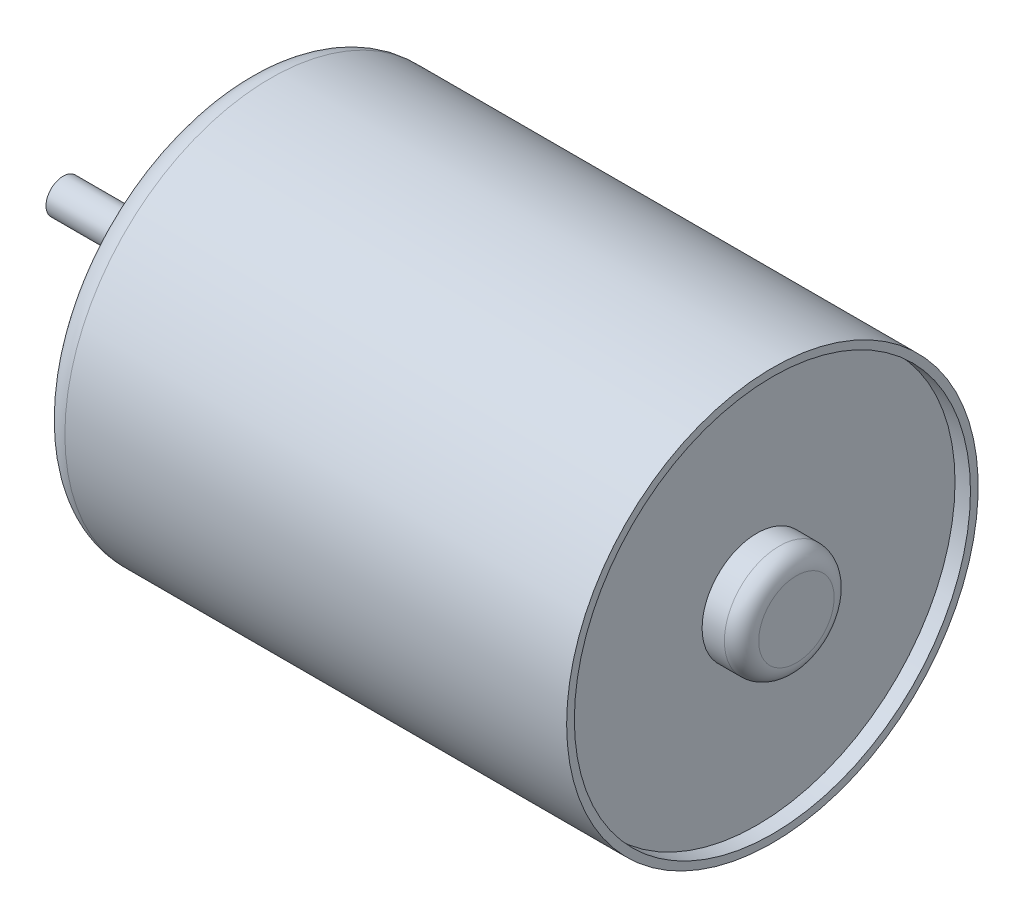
ISO-10303-21;
HEADER;
FILE_DESCRIPTION(('STEP AP214'),'2;1');
FILE_NAME('part.step','',(''),(''),'','','');
FILE_SCHEMA(('AUTOMOTIVE_DESIGN { 1 0 10303 214 1 1 1 1 }'));
ENDSEC;
DATA;
#1=APPLICATION_CONTEXT('core data for automotive mechanical design processes');
#2=APPLICATION_PROTOCOL_DEFINITION('international standard','automotive_design',2000,#1);
#3=PRODUCT_CONTEXT('',#1,'mechanical');
#4=PRODUCT('Part','Part','',(#3));
#5=PRODUCT_RELATED_PRODUCT_CATEGORY('part','',(#4));
#6=PRODUCT_DEFINITION_FORMATION('','',#4);
#7=PRODUCT_DEFINITION_CONTEXT('part definition',#1,'design');
#8=PRODUCT_DEFINITION('design','',#6,#7);
#9=PRODUCT_DEFINITION_SHAPE('','',#8);
#10=(LENGTH_UNIT() NAMED_UNIT(*) SI_UNIT(.MILLI.,.METRE.));
#11=(NAMED_UNIT(*) PLANE_ANGLE_UNIT() SI_UNIT($,.RADIAN.));
#12=(NAMED_UNIT(*) SI_UNIT($,.STERADIAN.) SOLID_ANGLE_UNIT());
#13=UNCERTAINTY_MEASURE_WITH_UNIT(LENGTH_MEASURE(1.E-05),#10,'distance_accuracy_value','');
#14=(GEOMETRIC_REPRESENTATION_CONTEXT(3) GLOBAL_UNCERTAINTY_ASSIGNED_CONTEXT((#13)) GLOBAL_UNIT_ASSIGNED_CONTEXT((#10,
#11,#12)) REPRESENTATION_CONTEXT('',''));
#15=CARTESIAN_POINT('',(0.,0.,0.));
#16=DIRECTION('',(0.,0.,1.));
#17=DIRECTION('',(1.,0.,0.));
#18=AXIS2_PLACEMENT_3D('',#15,#16,#17);
#19=CARTESIAN_POINT('',(-1.07616271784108,27.1669435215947,0.));
#20=DIRECTION('',(-1.,0.,0.));
#21=DIRECTION('',(0.,0.,1.));
#22=AXIS2_PLACEMENT_3D('',#19,#20,#21);
#23=PLANE('',#22);
#24=CARTESIAN_POINT('',(-1.07616271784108,27.1669435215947,0.));
#25=DIRECTION('',(-1.,0.,0.));
#26=DIRECTION('',(0.,0.,1.));
#27=AXIS2_PLACEMENT_3D('',#24,#25,#26);
#28=CIRCLE('',#27,11.55);
#29=CARTESIAN_POINT('',(-1.07616271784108,27.1669435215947,11.55));
#30=VERTEX_POINT('',#29);
#31=EDGE_CURVE('E54',#30,#30,#28,.T.);
#32=ORIENTED_EDGE('',*,*,#31,.F.);
#33=EDGE_LOOP('',(#32));
#34=FACE_BOUND('',#33,.T.);
#35=CARTESIAN_POINT('',(-1.07616271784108,27.1669435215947,0.));
#36=DIRECTION('',(-1.,0.,0.));
#37=DIRECTION('',(0.,0.,1.));
#38=AXIS2_PLACEMENT_3D('',#35,#36,#37);
#39=CIRCLE('',#38,3.2);
#40=CARTESIAN_POINT('',(-1.07616271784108,27.1669435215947,3.2));
#41=VERTEX_POINT('',#40);
#42=EDGE_CURVE('E42',#41,#41,#39,.F.);
#43=ORIENTED_EDGE('',*,*,#42,.F.);
#44=EDGE_LOOP('',(#43));
#45=FACE_BOUND('',#44,.T.);
#46=ADVANCED_FACE('F31',(#34,#45),#23,.F.);
#47=CARTESIAN_POINT('',(-41.5361627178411,27.1669435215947,0.));
#48=DIRECTION('',(-1.,0.,0.));
#49=DIRECTION('',(0.,0.,1.));
#50=AXIS2_PLACEMENT_3D('',#47,#48,#49);
#51=CYLINDRICAL_SURFACE('',#50,11.55);
#52=CARTESIAN_POINT('',(-0.176162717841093,27.1669435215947,0.));
#53=DIRECTION('',(-1.,0.,0.));
#54=DIRECTION('',(0.,0.,1.));
#55=AXIS2_PLACEMENT_3D('',#52,#53,#54);
#56=CIRCLE('',#55,11.55);
#57=CARTESIAN_POINT('',(-0.176162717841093,27.1669435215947,11.55));
#58=VERTEX_POINT('',#57);
#59=EDGE_CURVE('E57',#58,#58,#56,.T.);
#60=ORIENTED_EDGE('',*,*,#59,.F.);
#61=EDGE_LOOP('',(#60));
#62=FACE_BOUND('',#61,.T.);
#63=ORIENTED_EDGE('',*,*,#31,.T.);
#64=EDGE_LOOP('',(#63));
#65=FACE_BOUND('',#64,.T.);
#66=ADVANCED_FACE('F126',(#62,#65),#51,.F.);
#67=CARTESIAN_POINT('',(-0.176162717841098,39.1669435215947,0.));
#68=DIRECTION('',(-1.,0.,0.));
#69=DIRECTION('',(0.,0.,1.));
#70=AXIS2_PLACEMENT_3D('',#67,#68,#69);
#71=PLANE('',#70);
#72=CARTESIAN_POINT('',(-0.1761627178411,27.1669435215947,0.));
#73=DIRECTION('',(-1.,0.,0.));
#74=DIRECTION('',(0.,0.,1.));
#75=AXIS2_PLACEMENT_3D('',#72,#73,#74);
#76=CIRCLE('',#75,12.);
#77=CARTESIAN_POINT('',(-0.1761627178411,27.1669435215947,12.));
#78=VERTEX_POINT('',#77);
#79=EDGE_CURVE('E60',#78,#78,#76,.T.);
#80=ORIENTED_EDGE('',*,*,#79,.F.);
#81=EDGE_LOOP('',(#80));
#82=FACE_BOUND('',#81,.T.);
#83=ORIENTED_EDGE('',*,*,#59,.T.);
#84=EDGE_LOOP('',(#83));
#85=FACE_BOUND('',#84,.T.);
#86=ADVANCED_FACE('F122',(#82,#85),#71,.F.);
#87=CARTESIAN_POINT('',(-41.5361627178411,27.1669435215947,0.));
#88=DIRECTION('',(-1.,0.,0.));
#89=DIRECTION('',(0.,0.,1.));
#90=AXIS2_PLACEMENT_3D('',#87,#88,#89);
#91=CYLINDRICAL_SURFACE('',#90,12.);
#92=CARTESIAN_POINT('',(-29.4361627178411,27.1669435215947,0.));
#93=DIRECTION('',(1.,0.,0.));
#94=DIRECTION('',(0.,0.,-1.));
#95=AXIS2_PLACEMENT_3D('',#92,#93,#94);
#96=CIRCLE('',#95,12.);
#97=CARTESIAN_POINT('',(-29.4361627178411,27.1669435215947,-12.));
#98=VERTEX_POINT('',#97);
#99=EDGE_CURVE('E46',#98,#98,#96,.T.);
#100=ORIENTED_EDGE('',*,*,#99,.T.);
#101=EDGE_LOOP('',(#100));
#102=FACE_BOUND('',#101,.T.);
#103=ORIENTED_EDGE('',*,*,#79,.T.);
#104=EDGE_LOOP('',(#103));
#105=FACE_BOUND('',#104,.T.);
#106=ADVANCED_FACE('F116',(#102,#105),#91,.T.);
#107=CARTESIAN_POINT('',(-30.9361627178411,30.3669435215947,0.));
#108=DIRECTION('',(1.,0.,0.));
#109=DIRECTION('',(0.,0.,-1.));
#110=AXIS2_PLACEMENT_3D('',#107,#108,#109);
#111=PLANE('',#110);
#112=CARTESIAN_POINT('',(-30.9361627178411,27.1669435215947,0.));
#113=DIRECTION('',(1.,0.,0.));
#114=DIRECTION('',(0.,0.,-1.));
#115=AXIS2_PLACEMENT_3D('',#112,#113,#114);
#116=CIRCLE('',#115,10.5);
#117=CARTESIAN_POINT('',(-30.9361627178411,27.1669435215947,-10.5));
#118=VERTEX_POINT('',#117);
#119=EDGE_CURVE('E51',#118,#118,#116,.F.);
#120=ORIENTED_EDGE('',*,*,#119,.T.);
#121=EDGE_LOOP('',(#120));
#122=FACE_BOUND('',#121,.T.);
#123=CARTESIAN_POINT('',(-30.9361627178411,27.1669435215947,0.));
#124=DIRECTION('',(-1.,0.,0.));
#125=DIRECTION('',(0.,0.,1.));
#126=AXIS2_PLACEMENT_3D('',#123,#124,#125);
#127=CIRCLE('',#126,3.2);
#128=CARTESIAN_POINT('',(-30.9361627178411,27.1669435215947,3.2));
#129=VERTEX_POINT('',#128);
#130=EDGE_CURVE('E63',#129,#129,#127,.T.);
#131=ORIENTED_EDGE('',*,*,#130,.F.);
#132=EDGE_LOOP('',(#131));
#133=FACE_BOUND('',#132,.T.);
#134=ADVANCED_FACE('F111',(#122,#133),#111,.F.);
#135=CARTESIAN_POINT('',(-41.5361627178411,27.1669435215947,0.));
#136=DIRECTION('',(-1.,0.,0.));
#137=DIRECTION('',(0.,0.,1.));
#138=AXIS2_PLACEMENT_3D('',#135,#136,#137);
#139=CYLINDRICAL_SURFACE('',#138,3.2);
#140=CARTESIAN_POINT('',(-32.5361627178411,27.1669435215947,0.));
#141=DIRECTION('',(-1.,0.,0.));
#142=DIRECTION('',(0.,0.,1.));
#143=AXIS2_PLACEMENT_3D('',#140,#141,#142);
#144=CIRCLE('',#143,3.2);
#145=CARTESIAN_POINT('',(-32.5361627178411,27.1669435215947,3.2));
#146=VERTEX_POINT('',#145);
#147=EDGE_CURVE('E66',#146,#146,#144,.T.);
#148=ORIENTED_EDGE('',*,*,#147,.F.);
#149=EDGE_LOOP('',(#148));
#150=FACE_BOUND('',#149,.T.);
#151=ORIENTED_EDGE('',*,*,#130,.T.);
#152=EDGE_LOOP('',(#151));
#153=FACE_BOUND('',#152,.T.);
#154=ADVANCED_FACE('F105',(#150,#153),#139,.T.);
#155=CARTESIAN_POINT('',(-32.5361627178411,29.7669435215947,0.));
#156=DIRECTION('',(1.,0.,0.));
#157=DIRECTION('',(0.,0.,-1.));
#158=AXIS2_PLACEMENT_3D('',#155,#156,#157);
#159=PLANE('',#158);
#160=CARTESIAN_POINT('',(-32.5361627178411,27.1669435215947,0.));
#161=DIRECTION('',(-1.,0.,0.));
#162=DIRECTION('',(0.,0.,1.));
#163=AXIS2_PLACEMENT_3D('',#160,#161,#162);
#164=CIRCLE('',#163,2.6);
#165=CARTESIAN_POINT('',(-32.5361627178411,27.1669435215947,2.6));
#166=VERTEX_POINT('',#165);
#167=EDGE_CURVE('E69',#166,#166,#164,.T.);
#168=ORIENTED_EDGE('',*,*,#167,.F.);
#169=EDGE_LOOP('',(#168));
#170=FACE_BOUND('',#169,.T.);
#171=ORIENTED_EDGE('',*,*,#147,.T.);
#172=EDGE_LOOP('',(#171));
#173=FACE_BOUND('',#172,.T.);
#174=ADVANCED_FACE('F99',(#170,#173),#159,.F.);
#175=CARTESIAN_POINT('',(-41.5361627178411,27.1669435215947,0.));
#176=DIRECTION('',(-1.,0.,0.));
#177=DIRECTION('',(0.,0.,1.));
#178=AXIS2_PLACEMENT_3D('',#175,#176,#177);
#179=CYLINDRICAL_SURFACE('',#178,2.6);
#180=CARTESIAN_POINT('',(-32.0361627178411,27.1669435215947,0.));
#181=DIRECTION('',(-1.,0.,0.));
#182=DIRECTION('',(0.,0.,1.));
#183=AXIS2_PLACEMENT_3D('',#180,#181,#182);
#184=CIRCLE('',#183,2.6);
#185=CARTESIAN_POINT('',(-32.0361627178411,27.1669435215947,2.6));
#186=VERTEX_POINT('',#185);
#187=EDGE_CURVE('E72',#186,#186,#184,.T.);
#188=ORIENTED_EDGE('',*,*,#187,.F.);
#189=EDGE_LOOP('',(#188));
#190=FACE_BOUND('',#189,.T.);
#191=ORIENTED_EDGE('',*,*,#167,.T.);
#192=EDGE_LOOP('',(#191));
#193=FACE_BOUND('',#192,.T.);
#194=ADVANCED_FACE('F93',(#190,#193),#179,.F.);
#195=CARTESIAN_POINT('',(-32.0361627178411,28.1669435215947,0.));
#196=DIRECTION('',(1.,0.,0.));
#197=DIRECTION('',(0.,0.,-1.));
#198=AXIS2_PLACEMENT_3D('',#195,#196,#197);
#199=PLANE('',#198);
#200=CARTESIAN_POINT('',(-32.0361627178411,27.1669435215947,0.));
#201=DIRECTION('',(-1.,0.,0.));
#202=DIRECTION('',(0.,0.,1.));
#203=AXIS2_PLACEMENT_3D('',#200,#201,#202);
#204=CIRCLE('',#203,1.);
#205=CARTESIAN_POINT('',(-32.0361627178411,27.1669435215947,1.));
#206=VERTEX_POINT('',#205);
#207=EDGE_CURVE('E75',#206,#206,#204,.T.);
#208=ORIENTED_EDGE('',*,*,#207,.F.);
#209=EDGE_LOOP('',(#208));
#210=FACE_BOUND('',#209,.T.);
#211=ORIENTED_EDGE('',*,*,#187,.T.);
#212=EDGE_LOOP('',(#211));
#213=FACE_BOUND('',#212,.T.);
#214=ADVANCED_FACE('F87',(#210,#213),#199,.F.);
#215=CARTESIAN_POINT('',(-41.5361627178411,27.1669435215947,0.));
#216=DIRECTION('',(-1.,0.,0.));
#217=DIRECTION('',(0.,0.,1.));
#218=AXIS2_PLACEMENT_3D('',#215,#216,#217);
#219=CYLINDRICAL_SURFACE('',#218,1.);
#220=CARTESIAN_POINT('',(-41.5361627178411,27.1669435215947,0.));
#221=DIRECTION('',(-1.,0.,0.));
#222=DIRECTION('',(0.,0.,1.));
#223=AXIS2_PLACEMENT_3D('',#220,#221,#222);
#224=CIRCLE('',#223,1.);
#225=CARTESIAN_POINT('',(-41.5361627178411,27.1669435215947,1.));
#226=VERTEX_POINT('',#225);
#227=EDGE_CURVE('E78',#226,#226,#224,.T.);
#228=ORIENTED_EDGE('',*,*,#227,.F.);
#229=EDGE_LOOP('',(#228));
#230=FACE_BOUND('',#229,.T.);
#231=ORIENTED_EDGE('',*,*,#207,.T.);
#232=EDGE_LOOP('',(#231));
#233=FACE_BOUND('',#232,.T.);
#234=ADVANCED_FACE('F84',(#230,#233),#219,.T.);
#235=CARTESIAN_POINT('',(-41.5361627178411,27.1669435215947,0.));
#236=DIRECTION('',(1.,0.,0.));
#237=DIRECTION('',(0.,0.,-1.));
#238=AXIS2_PLACEMENT_3D('',#235,#236,#237);
#239=PLANE('',#238);
#240=ORIENTED_EDGE('',*,*,#227,.T.);
#241=EDGE_LOOP('',(#240));
#242=FACE_BOUND('',#241,.T.);
#243=ADVANCED_FACE('F82',(#242),#239,.F.);
#244=CARTESIAN_POINT('',(-29.4361627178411,27.1669435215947,0.));
#245=DIRECTION('',(1.,0.,0.));
#246=DIRECTION('',(0.,0.,-1.));
#247=AXIS2_PLACEMENT_3D('',#244,#245,#246);
#248=TOROIDAL_SURFACE('',#247,10.5,1.5);
#249=ORIENTED_EDGE('',*,*,#99,.F.);
#250=EDGE_LOOP('',(#249));
#251=FACE_BOUND('',#250,.T.);
#252=ORIENTED_EDGE('',*,*,#119,.F.);
#253=EDGE_LOOP('',(#252));
#254=FACE_BOUND('',#253,.T.);
#255=ADVANCED_FACE('F137',(#251,#254),#248,.T.);
#256=CARTESIAN_POINT('',(1.22383728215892,27.1669435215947,0.));
#257=DIRECTION('',(-1.,0.,0.));
#258=DIRECTION('',(0.,0.,1.));
#259=AXIS2_PLACEMENT_3D('',#256,#257,#258);
#260=CYLINDRICAL_SURFACE('',#259,3.2);
#261=CARTESIAN_POINT('',(0.223837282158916,27.1669435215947,0.));
#262=DIRECTION('',(1.,0.,0.));
#263=DIRECTION('',(0.,0.,-1.));
#264=AXIS2_PLACEMENT_3D('',#261,#262,#263);
#265=CIRCLE('',#264,3.2);
#266=CARTESIAN_POINT('',(0.223837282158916,27.1669435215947,-3.2));
#267=VERTEX_POINT('',#266);
#268=EDGE_CURVE('E10',#267,#267,#265,.F.);
#269=ORIENTED_EDGE('',*,*,#268,.T.);
#270=EDGE_LOOP('',(#269));
#271=FACE_BOUND('',#270,.T.);
#272=ORIENTED_EDGE('',*,*,#42,.T.);
#273=EDGE_LOOP('',(#272));
#274=FACE_BOUND('',#273,.T.);
#275=ADVANCED_FACE('F139',(#271,#274),#260,.T.);
#276=CARTESIAN_POINT('',(1.22383728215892,27.1669435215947,0.));
#277=DIRECTION('',(1.,0.,0.));
#278=DIRECTION('',(0.,0.,-1.));
#279=AXIS2_PLACEMENT_3D('',#276,#277,#278);
#280=PLANE('',#279);
#281=CARTESIAN_POINT('',(1.22383728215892,27.1669435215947,0.));
#282=DIRECTION('',(1.,0.,0.));
#283=DIRECTION('',(0.,0.,-1.));
#284=AXIS2_PLACEMENT_3D('',#281,#282,#283);
#285=CIRCLE('',#284,2.2);
#286=CARTESIAN_POINT('',(1.22383728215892,27.1669435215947,-2.2));
#287=VERTEX_POINT('',#286);
#288=EDGE_CURVE('E38',#287,#287,#285,.T.);
#289=ORIENTED_EDGE('',*,*,#288,.T.);
#290=EDGE_LOOP('',(#289));
#291=FACE_BOUND('',#290,.T.);
#292=ADVANCED_FACE('F145',(#291),#280,.T.);
#293=CARTESIAN_POINT('',(0.223837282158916,27.1669435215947,0.));
#294=DIRECTION('',(1.,0.,0.));
#295=DIRECTION('',(0.,0.,-1.));
#296=AXIS2_PLACEMENT_3D('',#293,#294,#295);
#297=TOROIDAL_SURFACE('',#296,2.2,1.);
#298=ORIENTED_EDGE('',*,*,#268,.F.);
#299=EDGE_LOOP('',(#298));
#300=FACE_BOUND('',#299,.T.);
#301=ORIENTED_EDGE('',*,*,#288,.F.);
#302=EDGE_LOOP('',(#301));
#303=FACE_BOUND('',#302,.T.);
#304=ADVANCED_FACE('F33',(#300,#303),#297,.T.);
#305=CLOSED_SHELL('',(#46,#66,#86,#106,#134,#154,#174,#194,#214,#234,#243,#255,#275,#292,#304));
#306=MANIFOLD_SOLID_BREP('B2',#305);
#307=ADVANCED_BREP_SHAPE_REPRESENTATION('',(#18,#306),#14);
#308=SHAPE_DEFINITION_REPRESENTATION(#9,#307);
ENDSEC;
END-ISO-10303-21;
